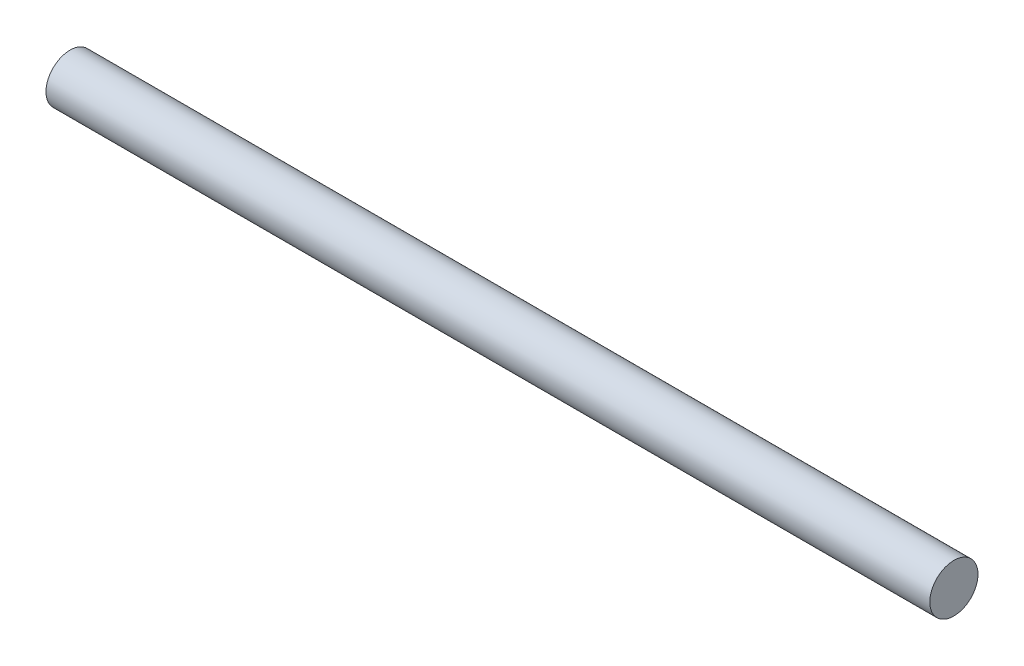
ISO-10303-21;
HEADER;
FILE_DESCRIPTION(('STEP AP214'),'2;1');
FILE_NAME('part.step','',(''),(''),'','','');
FILE_SCHEMA(('AUTOMOTIVE_DESIGN { 1 0 10303 214 1 1 1 1 }'));
ENDSEC;
DATA;
#1=APPLICATION_CONTEXT('core data for automotive mechanical design processes');
#2=APPLICATION_PROTOCOL_DEFINITION('international standard','automotive_design',2000,#1);
#3=PRODUCT_CONTEXT('',#1,'mechanical');
#4=PRODUCT('Part','Part','',(#3));
#5=PRODUCT_RELATED_PRODUCT_CATEGORY('part','',(#4));
#6=PRODUCT_DEFINITION_FORMATION('','',#4);
#7=PRODUCT_DEFINITION_CONTEXT('part definition',#1,'design');
#8=PRODUCT_DEFINITION('design','',#6,#7);
#9=PRODUCT_DEFINITION_SHAPE('','',#8);
#10=(LENGTH_UNIT() NAMED_UNIT(*) SI_UNIT(.MILLI.,.METRE.));
#11=(NAMED_UNIT(*) PLANE_ANGLE_UNIT() SI_UNIT($,.RADIAN.));
#12=(NAMED_UNIT(*) SI_UNIT($,.STERADIAN.) SOLID_ANGLE_UNIT());
#13=UNCERTAINTY_MEASURE_WITH_UNIT(LENGTH_MEASURE(1.E-05),#10,'distance_accuracy_value','');
#14=(GEOMETRIC_REPRESENTATION_CONTEXT(3) GLOBAL_UNCERTAINTY_ASSIGNED_CONTEXT((#13)) GLOBAL_UNIT_ASSIGNED_CONTEXT((#10,
#11,#12)) REPRESENTATION_CONTEXT('',''));
#15=CARTESIAN_POINT('',(0.,0.,0.));
#16=DIRECTION('',(0.,0.,1.));
#17=DIRECTION('',(1.,0.,0.));
#18=AXIS2_PLACEMENT_3D('',#15,#16,#17);
#19=CARTESIAN_POINT('',(0.,0.,0.));
#20=DIRECTION('',(1.,0.,0.));
#21=DIRECTION('',(0.,0.,-1.));
#22=AXIS2_PLACEMENT_3D('',#19,#20,#21);
#23=PLANE('',#22);
#24=CARTESIAN_POINT('',(0.,0.,0.));
#25=DIRECTION('',(1.,0.,0.));
#26=DIRECTION('',(0.,0.,-1.));
#27=AXIS2_PLACEMENT_3D('',#24,#25,#26);
#28=CIRCLE('',#27,40.513);
#29=CARTESIAN_POINT('',(0.,0.,-40.513));
#30=VERTEX_POINT('',#29);
#31=EDGE_CURVE('E10',#30,#30,#28,.T.);
#32=ORIENTED_EDGE('',*,*,#31,.F.);
#33=EDGE_LOOP('',(#32));
#34=FACE_BOUND('',#33,.T.);
#35=ADVANCED_FACE('F373',(#34),#23,.F.);
#36=CARTESIAN_POINT('',(0.,0.,0.));
#37=DIRECTION('',(1.,0.,0.));
#38=DIRECTION('',(0.,0.,-1.));
#39=AXIS2_PLACEMENT_3D('',#36,#37,#38);
#40=CYLINDRICAL_SURFACE('',#39,40.513);
#41=CARTESIAN_POINT('',(1485.9,0.,0.));
#42=DIRECTION('',(1.,0.,0.));
#43=DIRECTION('',(0.,0.,-1.));
#44=AXIS2_PLACEMENT_3D('',#41,#42,#43);
#45=CIRCLE('',#44,40.513);
#46=CARTESIAN_POINT('',(1485.9,0.,-40.513));
#47=VERTEX_POINT('',#46);
#48=EDGE_CURVE('E379',#47,#47,#45,.T.);
#49=ORIENTED_EDGE('',*,*,#48,.F.);
#50=EDGE_LOOP('',(#49));
#51=FACE_BOUND('',#50,.T.);
#52=ORIENTED_EDGE('',*,*,#31,.T.);
#53=EDGE_LOOP('',(#52));
#54=FACE_BOUND('',#53,.T.);
#55=ADVANCED_FACE('F387',(#51,#54),#40,.T.);
#56=CARTESIAN_POINT('',(1485.9,0.,0.));
#57=DIRECTION('',(-1.,0.,0.));
#58=DIRECTION('',(0.,0.,1.));
#59=AXIS2_PLACEMENT_3D('',#56,#57,#58);
#60=PLANE('',#59);
#61=ORIENTED_EDGE('',*,*,#48,.T.);
#62=EDGE_LOOP('',(#61));
#63=FACE_BOUND('',#62,.T.);
#64=ADVANCED_FACE('F385',(#63),#60,.F.);
#65=CLOSED_SHELL('',(#35,#55,#64));
#66=MANIFOLD_SOLID_BREP('B2',#65);
#67=ADVANCED_BREP_SHAPE_REPRESENTATION('',(#18,#66),#14);
#68=SHAPE_DEFINITION_REPRESENTATION(#9,#67);
ENDSEC;
END-ISO-10303-21;
